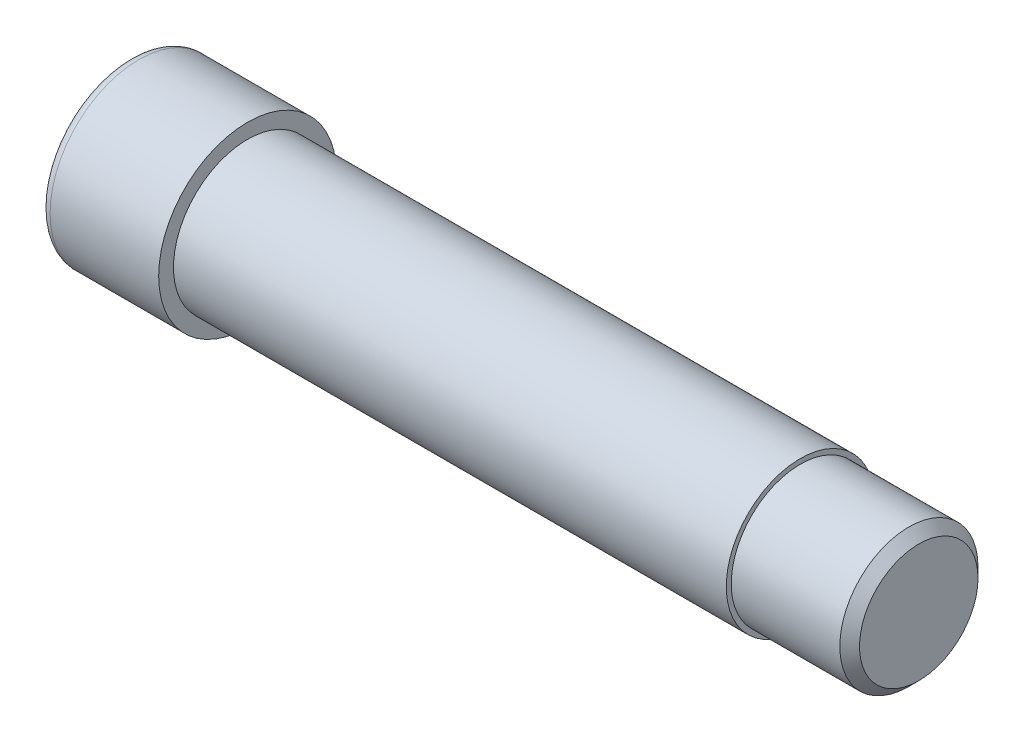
from build123d import *

# Parameters (mm, degrees)
CHANFREIN1_SIZE         = 1
CONG_1_R                = 1
ENL_V_MAT_EXTRU_1_DEPTH = 10
CONG_2_R                = 0.5


with BuildPart() as part:
    # Esquisse1 → R_volution1 (revolve)
    with BuildSketch(Plane(origin=(0, 0, 0), x_dir=(1, 0, 0), z_dir=(0, 1, 0))):
        Polygon((0, 0), (0, 7), (-12, 7), (-12, 7.5), (-68, 7.5), (-68, 9), (-80, 9), (-80, 0), align=None)
    revolve(axis=Axis((0, 0, 0), (-1, 0, 0)))

    # Chanfrein1
    chanfrein1_edges = [part.edges().sort_by_distance(p)[0] for p in [
        (0, 0, 7),
    ]]
    chamfer(chanfrein1_edges, length=CHANFREIN1_SIZE)

    # Cong_1
    cong_1_edges = [part.edges().sort_by_distance(p)[0] for p in [
        (-80, 0, 9),
    ]]
    fillet(cong_1_edges, radius=CONG_1_R)

    # Esquisse2 → Enl_v. mat.-Extru.1 (cut)
    with BuildSketch(Plane.ZY.offset(80)):
        Polygon((-2.5, -4.330127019), (-5, 0), (-2.5, 4.330127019), (2.5, 4.330127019), (5, 0), (2.5, -4.330127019), align=None)
    extrude(amount=-ENL_V_MAT_EXTRU_1_DEPTH, mode=Mode.SUBTRACT)

    # Cong_2
    cong_2_edges = [part.edges().sort_by_distance(p)[0] for p in [
        (-70, 2.165063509, -3.75),
        (-75, 0, -5),
        (-70, 4.330127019, 0),
        (-75, 4.330127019, -2.5),
        (-70, 2.165063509, 3.75),
        (-75, 4.330127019, 2.5),
        (-70, -2.165063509, 3.75),
        (-75, 0, 5),
        (-70, -4.330127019, 0),
        (-75, -4.330127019, 2.5),
        (-70, -2.165063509, -3.75),
        (-75, -4.330127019, -2.5),
        (-80, 2.165063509, -3.75),
        (-80, -2.165063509, -3.75),
        (-80, -4.330127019, 0),
        (-80, -2.165063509, 3.75),
        (-80, 2.165063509, 3.75),
        (-80, 4.330127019, 0),
    ]]
    fillet(cong_2_edges, radius=CONG_2_R)


solid = part.part
